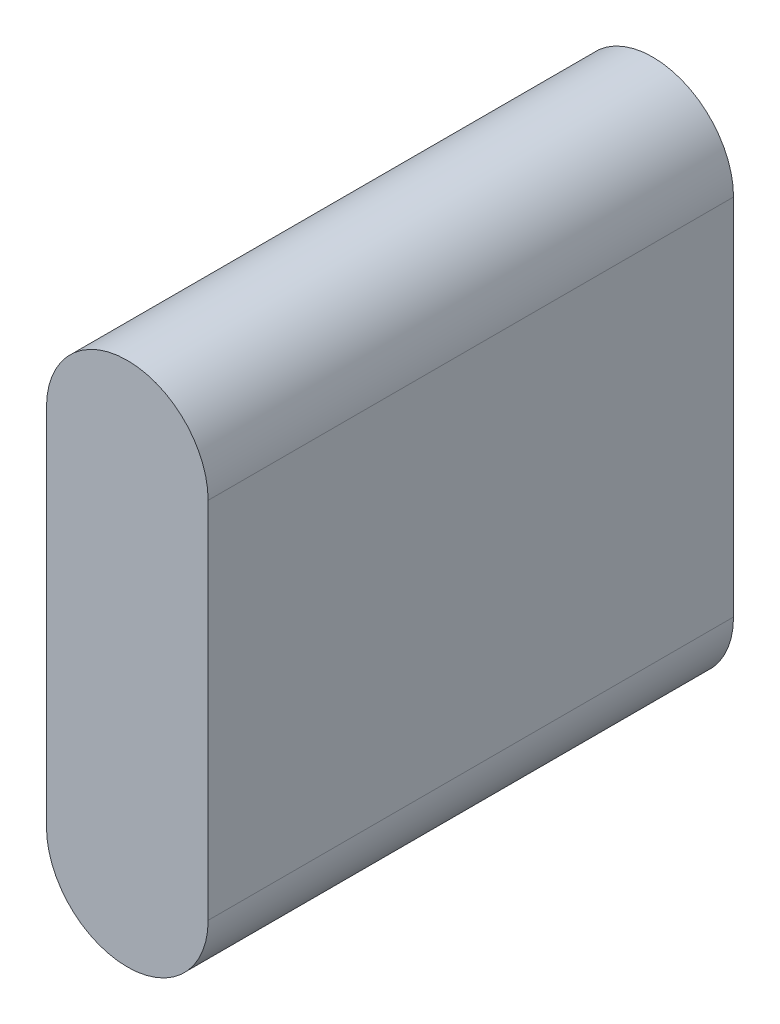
ISO-10303-21;
HEADER;
FILE_DESCRIPTION(('STEP AP214'),'2;1');
FILE_NAME('part.step','',(''),(''),'','','');
FILE_SCHEMA(('AUTOMOTIVE_DESIGN { 1 0 10303 214 1 1 1 1 }'));
ENDSEC;
DATA;
#1=APPLICATION_CONTEXT('core data for automotive mechanical design processes');
#2=APPLICATION_PROTOCOL_DEFINITION('international standard','automotive_design',2000,#1);
#3=PRODUCT_CONTEXT('',#1,'mechanical');
#4=PRODUCT('Part','Part','',(#3));
#5=PRODUCT_RELATED_PRODUCT_CATEGORY('part','',(#4));
#6=PRODUCT_DEFINITION_FORMATION('','',#4);
#7=PRODUCT_DEFINITION_CONTEXT('part definition',#1,'design');
#8=PRODUCT_DEFINITION('design','',#6,#7);
#9=PRODUCT_DEFINITION_SHAPE('','',#8);
#10=(LENGTH_UNIT() NAMED_UNIT(*) SI_UNIT(.MILLI.,.METRE.));
#11=(NAMED_UNIT(*) PLANE_ANGLE_UNIT() SI_UNIT($,.RADIAN.));
#12=(NAMED_UNIT(*) SI_UNIT($,.STERADIAN.) SOLID_ANGLE_UNIT());
#13=UNCERTAINTY_MEASURE_WITH_UNIT(LENGTH_MEASURE(1.E-05),#10,'distance_accuracy_value','');
#14=(GEOMETRIC_REPRESENTATION_CONTEXT(3) GLOBAL_UNCERTAINTY_ASSIGNED_CONTEXT((#13)) GLOBAL_UNIT_ASSIGNED_CONTEXT((#10,
#11,#12)) REPRESENTATION_CONTEXT('',''));
#15=CARTESIAN_POINT('',(0.,0.,0.));
#16=DIRECTION('',(0.,0.,1.));
#17=DIRECTION('',(1.,0.,0.));
#18=AXIS2_PLACEMENT_3D('',#15,#16,#17);
#19=CARTESIAN_POINT('',(2.,38.5,0.));
#20=DIRECTION('',(-1.,0.,0.));
#21=DIRECTION('',(0.,0.,1.));
#22=AXIS2_PLACEMENT_3D('',#19,#20,#21);
#23=PLANE('',#22);
#24=DIRECTION('',(0.,1.,0.));
#25=VECTOR('',#24,1.);
#26=CARTESIAN_POINT('',(2.,0.,-3.));
#27=LINE('',#26,#25);
#28=CARTESIAN_POINT('',(2.,29.5,-3.));
#29=VERTEX_POINT('',#28);
#30=CARTESIAN_POINT('',(2.,38.5,-3.));
#31=VERTEX_POINT('',#30);
#32=EDGE_CURVE('E73',#29,#31,#27,.T.);
#33=ORIENTED_EDGE('',*,*,#32,.T.);
#34=DIRECTION('',(0.,0.,1.));
#35=VECTOR('',#34,1.);
#36=CARTESIAN_POINT('',(2.,38.5,3.5));
#37=LINE('',#36,#35);
#38=CARTESIAN_POINT('',(2.,38.5,9.99999999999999));
#39=VERTEX_POINT('',#38);
#40=EDGE_CURVE('E64',#39,#31,#37,.F.);
#41=ORIENTED_EDGE('',*,*,#40,.F.);
#42=DIRECTION('',(0.,1.,0.));
#43=VECTOR('',#42,1.);
#44=CARTESIAN_POINT('',(2.,0.,9.99999999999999));
#45=LINE('',#44,#43);
#46=CARTESIAN_POINT('',(2.,29.5,9.99999999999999));
#47=VERTEX_POINT('',#46);
#48=EDGE_CURVE('E60',#47,#39,#45,.T.);
#49=ORIENTED_EDGE('',*,*,#48,.F.);
#50=DIRECTION('',(0.,0.,1.));
#51=VECTOR('',#50,1.);
#52=CARTESIAN_POINT('',(2.,29.5,3.5));
#53=LINE('',#52,#51);
#54=EDGE_CURVE('E50',#29,#47,#53,.T.);
#55=ORIENTED_EDGE('',*,*,#54,.F.);
#56=EDGE_LOOP('',(#33,#41,#49,#55));
#57=FACE_BOUND('',#56,.T.);
#58=ADVANCED_FACE('F16',(#57),#23,.F.);
#59=CARTESIAN_POINT('',(0.,0.,9.99999999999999));
#60=DIRECTION('',(0.,0.,1.));
#61=DIRECTION('',(1.,0.,0.));
#62=AXIS2_PLACEMENT_3D('',#59,#60,#61);
#63=PLANE('',#62);
#64=CARTESIAN_POINT('',(0.,29.5,9.99999999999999));
#65=DIRECTION('',(0.,0.,1.));
#66=DIRECTION('',(1.,0.,0.));
#67=AXIS2_PLACEMENT_3D('',#64,#65,#66);
#68=CIRCLE('',#67,2.);
#69=CARTESIAN_POINT('',(-2.,29.5,9.99999999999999));
#70=VERTEX_POINT('',#69);
#71=EDGE_CURVE('E20',#47,#70,#68,.F.);
#72=ORIENTED_EDGE('',*,*,#71,.F.);
#73=ORIENTED_EDGE('',*,*,#48,.T.);
#74=CARTESIAN_POINT('',(0.,38.5,9.99999999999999));
#75=DIRECTION('',(0.,0.,1.));
#76=DIRECTION('',(1.,0.,0.));
#77=AXIS2_PLACEMENT_3D('',#74,#75,#76);
#78=CIRCLE('',#77,2.);
#79=CARTESIAN_POINT('',(-2.,38.5,9.99999999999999));
#80=VERTEX_POINT('',#79);
#81=EDGE_CURVE('E77',#80,#39,#78,.F.);
#82=ORIENTED_EDGE('',*,*,#81,.F.);
#83=DIRECTION('',(0.,1.,0.));
#84=VECTOR('',#83,1.);
#85=CARTESIAN_POINT('',(-2.,29.5,9.99999999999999));
#86=LINE('',#85,#84);
#87=EDGE_CURVE('E72',#80,#70,#86,.F.);
#88=ORIENTED_EDGE('',*,*,#87,.T.);
#89=EDGE_LOOP('',(#72,#73,#82,#88));
#90=FACE_BOUND('',#89,.T.);
#91=ADVANCED_FACE('F70',(#90),#63,.T.);
#92=CARTESIAN_POINT('',(0.,29.5,3.5));
#93=DIRECTION('',(0.,0.,1.));
#94=DIRECTION('',(1.,0.,0.));
#95=AXIS2_PLACEMENT_3D('',#92,#93,#94);
#96=CYLINDRICAL_SURFACE('',#95,2.);
#97=ORIENTED_EDGE('',*,*,#54,.T.);
#98=ORIENTED_EDGE('',*,*,#71,.T.);
#99=DIRECTION('',(0.,0.,-1.));
#100=VECTOR('',#99,1.);
#101=CARTESIAN_POINT('',(-2.,29.5,0.));
#102=LINE('',#101,#100);
#103=CARTESIAN_POINT('',(-2.,29.5,-3.));
#104=VERTEX_POINT('',#103);
#105=EDGE_CURVE('E80',#70,#104,#102,.T.);
#106=ORIENTED_EDGE('',*,*,#105,.T.);
#107=CARTESIAN_POINT('',(0.,29.5,-3.));
#108=DIRECTION('',(0.,0.,1.));
#109=DIRECTION('',(1.,0.,0.));
#110=AXIS2_PLACEMENT_3D('',#107,#108,#109);
#111=CIRCLE('',#110,2.);
#112=EDGE_CURVE('E56',#104,#29,#111,.T.);
#113=ORIENTED_EDGE('',*,*,#112,.T.);
#114=EDGE_LOOP('',(#97,#98,#106,#113));
#115=FACE_BOUND('',#114,.T.);
#116=ADVANCED_FACE('F52',(#115),#96,.T.);
#117=CARTESIAN_POINT('',(0.,0.,-3.));
#118=DIRECTION('',(0.,0.,1.));
#119=DIRECTION('',(1.,0.,0.));
#120=AXIS2_PLACEMENT_3D('',#117,#118,#119);
#121=PLANE('',#120);
#122=ORIENTED_EDGE('',*,*,#112,.F.);
#123=DIRECTION('',(0.,1.,0.));
#124=VECTOR('',#123,1.);
#125=CARTESIAN_POINT('',(-2.,29.5,-3.));
#126=LINE('',#125,#124);
#127=CARTESIAN_POINT('',(-2.,38.5,-3.));
#128=VERTEX_POINT('',#127);
#129=EDGE_CURVE('E26',#104,#128,#126,.T.);
#130=ORIENTED_EDGE('',*,*,#129,.T.);
#131=CARTESIAN_POINT('',(0.,38.5,-3.));
#132=DIRECTION('',(0.,0.,1.));
#133=DIRECTION('',(1.,0.,0.));
#134=AXIS2_PLACEMENT_3D('',#131,#132,#133);
#135=CIRCLE('',#134,2.);
#136=EDGE_CURVE('E34',#31,#128,#135,.T.);
#137=ORIENTED_EDGE('',*,*,#136,.F.);
#138=ORIENTED_EDGE('',*,*,#32,.F.);
#139=EDGE_LOOP('',(#122,#130,#137,#138));
#140=FACE_BOUND('',#139,.T.);
#141=ADVANCED_FACE('F90',(#140),#121,.F.);
#142=CARTESIAN_POINT('',(0.,38.5,3.5));
#143=DIRECTION('',(0.,0.,1.));
#144=DIRECTION('',(1.,0.,0.));
#145=AXIS2_PLACEMENT_3D('',#142,#143,#144);
#146=CYLINDRICAL_SURFACE('',#145,2.);
#147=DIRECTION('',(0.,0.,-1.));
#148=VECTOR('',#147,1.);
#149=CARTESIAN_POINT('',(-2.,38.5,0.));
#150=LINE('',#149,#148);
#151=EDGE_CURVE('E11',#128,#80,#150,.F.);
#152=ORIENTED_EDGE('',*,*,#151,.T.);
#153=ORIENTED_EDGE('',*,*,#81,.T.);
#154=ORIENTED_EDGE('',*,*,#40,.T.);
#155=ORIENTED_EDGE('',*,*,#136,.T.);
#156=EDGE_LOOP('',(#152,#153,#154,#155));
#157=FACE_BOUND('',#156,.T.);
#158=ADVANCED_FACE('F88',(#157),#146,.T.);
#159=CARTESIAN_POINT('',(-2.,29.5,0.));
#160=DIRECTION('',(1.,0.,0.));
#161=DIRECTION('',(0.,0.,-1.));
#162=AXIS2_PLACEMENT_3D('',#159,#160,#161);
#163=PLANE('',#162);
#164=ORIENTED_EDGE('',*,*,#129,.F.);
#165=ORIENTED_EDGE('',*,*,#105,.F.);
#166=ORIENTED_EDGE('',*,*,#87,.F.);
#167=ORIENTED_EDGE('',*,*,#151,.F.);
#168=EDGE_LOOP('',(#164,#165,#166,#167));
#169=FACE_BOUND('',#168,.T.);
#170=ADVANCED_FACE('F18',(#169),#163,.F.);
#171=CLOSED_SHELL('',(#58,#91,#116,#141,#158,#170));
#172=MANIFOLD_SOLID_BREP('B1',#171);
#173=ADVANCED_BREP_SHAPE_REPRESENTATION('',(#18,#172),#14);
#174=SHAPE_DEFINITION_REPRESENTATION(#9,#173);
ENDSEC;
END-ISO-10303-21;
